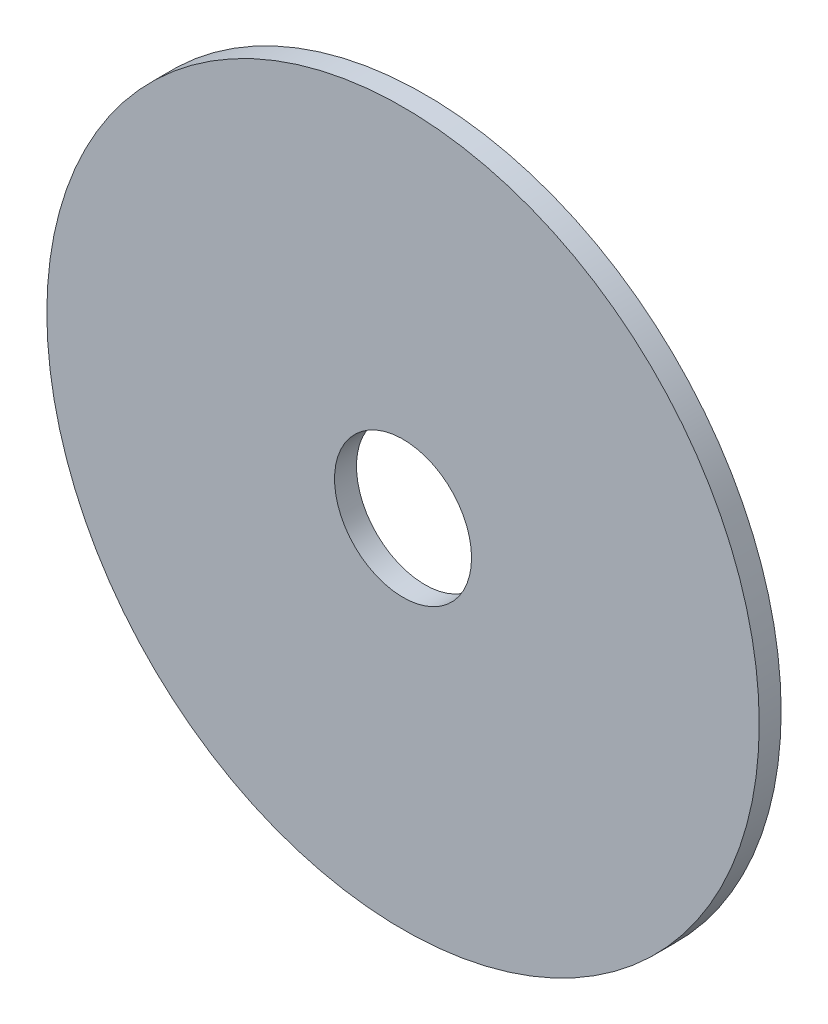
ISO-10303-21;
HEADER;
FILE_DESCRIPTION(('STEP AP214'),'2;1');
FILE_NAME('part.step','',(''),(''),'','','');
FILE_SCHEMA(('AUTOMOTIVE_DESIGN { 1 0 10303 214 1 1 1 1 }'));
ENDSEC;
DATA;
#1=APPLICATION_CONTEXT('core data for automotive mechanical design processes');
#2=APPLICATION_PROTOCOL_DEFINITION('international standard','automotive_design',2000,#1);
#3=PRODUCT_CONTEXT('',#1,'mechanical');
#4=PRODUCT('Part','Part','',(#3));
#5=PRODUCT_RELATED_PRODUCT_CATEGORY('part','',(#4));
#6=PRODUCT_DEFINITION_FORMATION('','',#4);
#7=PRODUCT_DEFINITION_CONTEXT('part definition',#1,'design');
#8=PRODUCT_DEFINITION('design','',#6,#7);
#9=PRODUCT_DEFINITION_SHAPE('','',#8);
#10=(LENGTH_UNIT() NAMED_UNIT(*) SI_UNIT(.MILLI.,.METRE.));
#11=(NAMED_UNIT(*) PLANE_ANGLE_UNIT() SI_UNIT($,.RADIAN.));
#12=(NAMED_UNIT(*) SI_UNIT($,.STERADIAN.) SOLID_ANGLE_UNIT());
#13=UNCERTAINTY_MEASURE_WITH_UNIT(LENGTH_MEASURE(1.E-05),#10,'distance_accuracy_value','');
#14=(GEOMETRIC_REPRESENTATION_CONTEXT(3) GLOBAL_UNCERTAINTY_ASSIGNED_CONTEXT((#13)) GLOBAL_UNIT_ASSIGNED_CONTEXT((#10,
#11,#12)) REPRESENTATION_CONTEXT('',''));
#15=CARTESIAN_POINT('',(0.,0.,0.));
#16=DIRECTION('',(0.,0.,1.));
#17=DIRECTION('',(1.,0.,0.));
#18=AXIS2_PLACEMENT_3D('',#15,#16,#17);
#19=CARTESIAN_POINT('',(0.,0.,2.));
#20=DIRECTION('',(0.,0.,1.));
#21=DIRECTION('',(1.,0.,0.));
#22=AXIS2_PLACEMENT_3D('',#19,#20,#21);
#23=PLANE('',#22);
#24=CARTESIAN_POINT('',(0.,0.,2.));
#25=DIRECTION('',(0.,0.,1.));
#26=DIRECTION('',(1.,0.,0.));
#27=AXIS2_PLACEMENT_3D('',#24,#25,#26);
#28=CIRCLE('',#27,32.5);
#29=CARTESIAN_POINT('',(32.5,0.,2.));
#30=VERTEX_POINT('',#29);
#31=EDGE_CURVE('E10',#30,#30,#28,.T.);
#32=ORIENTED_EDGE('',*,*,#31,.T.);
#33=EDGE_LOOP('',(#32));
#34=FACE_BOUND('',#33,.T.);
#35=CARTESIAN_POINT('',(0.,0.,2.));
#36=DIRECTION('',(0.,0.,1.));
#37=DIRECTION('',(1.,0.,0.));
#38=AXIS2_PLACEMENT_3D('',#35,#36,#37);
#39=CIRCLE('',#38,6.25);
#40=CARTESIAN_POINT('',(6.25,0.,2.));
#41=VERTEX_POINT('',#40);
#42=EDGE_CURVE('E44',#41,#41,#39,.T.);
#43=ORIENTED_EDGE('',*,*,#42,.F.);
#44=EDGE_LOOP('',(#43));
#45=FACE_BOUND('',#44,.T.);
#46=ADVANCED_FACE('F33',(#34,#45),#23,.T.);
#47=CARTESIAN_POINT('',(0.,0.,0.));
#48=DIRECTION('',(0.,0.,1.));
#49=DIRECTION('',(1.,0.,0.));
#50=AXIS2_PLACEMENT_3D('',#47,#48,#49);
#51=PLANE('',#50);
#52=CARTESIAN_POINT('',(0.,0.,0.));
#53=DIRECTION('',(0.,0.,1.));
#54=DIRECTION('',(1.,0.,0.));
#55=AXIS2_PLACEMENT_3D('',#52,#53,#54);
#56=CIRCLE('',#55,32.5);
#57=CARTESIAN_POINT('',(32.5,0.,0.));
#58=VERTEX_POINT('',#57);
#59=EDGE_CURVE('E40',#58,#58,#56,.T.);
#60=ORIENTED_EDGE('',*,*,#59,.F.);
#61=EDGE_LOOP('',(#60));
#62=FACE_BOUND('',#61,.T.);
#63=CARTESIAN_POINT('',(0.,0.,0.));
#64=DIRECTION('',(0.,0.,1.));
#65=DIRECTION('',(1.,0.,0.));
#66=AXIS2_PLACEMENT_3D('',#63,#64,#65);
#67=CIRCLE('',#66,6.25);
#68=CARTESIAN_POINT('',(6.25,0.,0.));
#69=VERTEX_POINT('',#68);
#70=EDGE_CURVE('E48',#69,#69,#67,.T.);
#71=ORIENTED_EDGE('',*,*,#70,.T.);
#72=EDGE_LOOP('',(#71));
#73=FACE_BOUND('',#72,.T.);
#74=ADVANCED_FACE('F54',(#62,#73),#51,.F.);
#75=CARTESIAN_POINT('',(0.,0.,2.));
#76=DIRECTION('',(0.,0.,-1.));
#77=DIRECTION('',(-1.,0.,0.));
#78=AXIS2_PLACEMENT_3D('',#75,#76,#77);
#79=CYLINDRICAL_SURFACE('',#78,32.5);
#80=ORIENTED_EDGE('',*,*,#31,.F.);
#81=EDGE_LOOP('',(#80));
#82=FACE_BOUND('',#81,.T.);
#83=ORIENTED_EDGE('',*,*,#59,.T.);
#84=EDGE_LOOP('',(#83));
#85=FACE_BOUND('',#84,.T.);
#86=ADVANCED_FACE('F35',(#82,#85),#79,.T.);
#87=CARTESIAN_POINT('',(0.,0.,2.));
#88=DIRECTION('',(0.,0.,-1.));
#89=DIRECTION('',(-1.,0.,0.));
#90=AXIS2_PLACEMENT_3D('',#87,#88,#89);
#91=CYLINDRICAL_SURFACE('',#90,6.25);
#92=ORIENTED_EDGE('',*,*,#42,.T.);
#93=EDGE_LOOP('',(#92));
#94=FACE_BOUND('',#93,.T.);
#95=ORIENTED_EDGE('',*,*,#70,.F.);
#96=EDGE_LOOP('',(#95));
#97=FACE_BOUND('',#96,.T.);
#98=ADVANCED_FACE('F56',(#94,#97),#91,.F.);
#99=CLOSED_SHELL('',(#46,#74,#86,#98));
#100=MANIFOLD_SOLID_BREP('B2',#99);
#101=ADVANCED_BREP_SHAPE_REPRESENTATION('',(#18,#100),#14);
#102=SHAPE_DEFINITION_REPRESENTATION(#9,#101);
ENDSEC;
END-ISO-10303-21;
